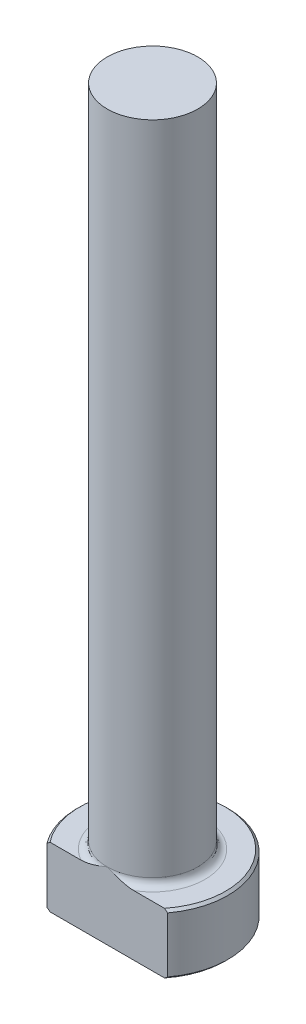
from build123d import *

# Parameters (mm, degrees)
CHAMFER1_SIZE = 0.254
FILLET1_R     = 0.762
KEY_DEPTH     = 78.022385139


with BuildPart() as part:
    # Sketch1 → Revolve1 (revolve)
    with BuildSketch(Plane.XY, mode=Mode.PRIVATE) as revolve1_sk:
        Polygon((0, 0), (-7.9375, 0), (-7.9375, 6.35), (-4.7625, 6.35), (-4.7625, 76.2), (0, 76.2), align=None)
    revolve(revolve1_sk.sketch.rotate(Axis((0, 259.958771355, 0), (0, -1, 0)), 270), axis=Axis((0, 259.958771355, 0), (0, -1, 0)))

    # Chamfer1
    chamfer1_edges = [part.edges().sort_by_distance(p)[0] for p in [
        (0, 6.35, -7.9375),
        (0, 0, -7.9375),
    ]]
    chamfer(chamfer1_edges, length=CHAMFER1_SIZE)

    # Fillet1
    fillet1_edges = [part.edges().sort_by_distance(p)[0] for p in [
        (0, 6.35, -4.7625),
    ]]
    fillet(fillet1_edges, radius=FILLET1_R)

    # Sketch2 → Key (cut, through all)
    with BuildSketch(Plane(origin=(0, 0, 0), x_dir=(1, 0, 0), z_dir=(0, 1, 0))):
        with BuildLine():
            Line((-6.35, -4.7625), (6.35, -4.7625))
            ThreePointArc((6.35, -4.7625), (0, -7.9375), (-6.35, -4.7625))
        make_face()
    extrude(amount=KEY_DEPTH, mode=Mode.SUBTRACT)


solid = part.part
